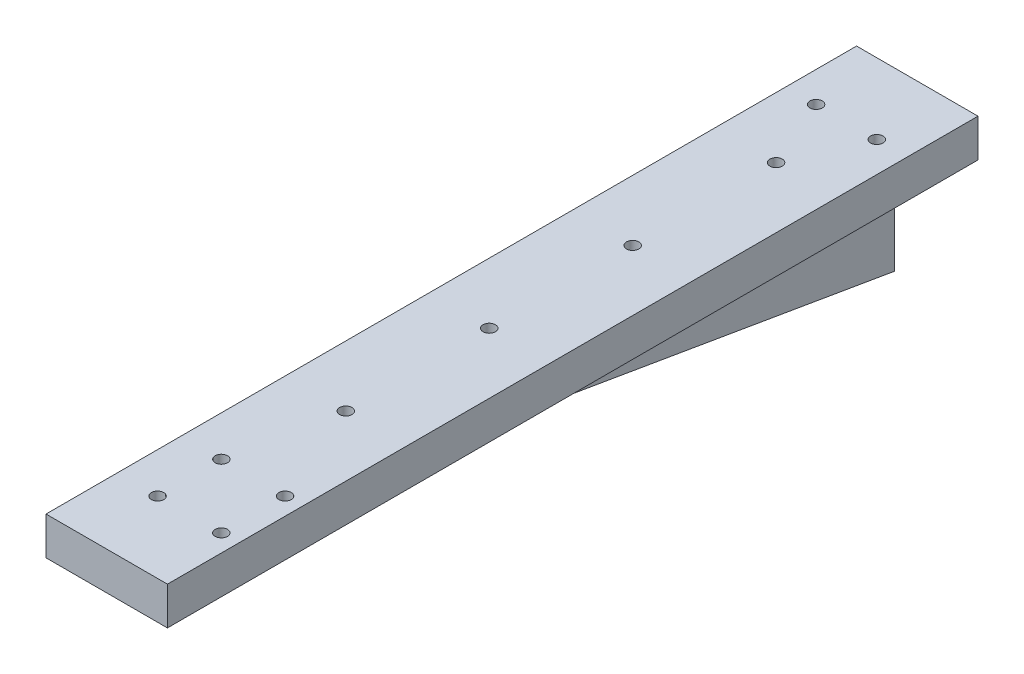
from build123d import *

# Parameters (mm, degrees)
SKETCH1_W                            = 25.4
SKETCH1_H                            = 7.9375
EXTRUDE1_DEPTH                       = 169.545
EXTRUDE2_DEPTH                       = 7.9375
FILLET1_R                            = 6.35
F_8_32_TAPPED_HOLE1_D                = 3.4544
F_8_32_TAPPED_HOLE1_DEPTH            = 10.70864
F_5_40_TAPPED_HOLE1_D                = 2.5781
F_5_40_TAPPED_HOLE1_DEPTH            = 10.795
F_5_40_TAPPED_HOLE1_TIP              = 0.774539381
F_5_40_TAPPED_HOLE2_D                = 2.5781
F_5_40_TAPPED_HOLE3_D                = 2.5781
F_3_16_0_187500_DIAMETER_HOLE1_D     = 4.7879
F_3_16_0_187500_DIAMETER_HOLE1_DEPTH = 6.35
F_3_16_0_187500_DIAMETER_HOLE1_TIP   = 1.438430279
F_5_40_TAPPED_HOLE4_D                = 2.5781
F_5_40_TAPPED_HOLE4_DEPTH            = 10.795
F_3_32_0_09375_DIAMETER_HOLE1_D      = 2.38125
F_3_32_0_09375_DIAMETER_HOLE1_DEPTH  = 3.81


with BuildPart() as part:
    # Sketch1 → Extrude1 (new body)
    with BuildSketch(Plane.XY):
        with Locations((0, -0.00635)):
            Rectangle(SKETCH1_W, SKETCH1_H)
    extrude(amount=EXTRUDE1_DEPTH)

    # Sketch3 → Extrude2 (add)
    with BuildSketch(Plane.ZY.offset(12.7)):
        Polygon((0, -3.9751), (0, -32.8676), (169.545, -3.9751), align=None)
    extrude(amount=-EXTRUDE2_DEPTH)

    # Fillet1
    fillet1_edges = [part.edges().sort_by_distance(p)[0] for p in [
        (-4.7625, -3.9751, 84.7725),
    ]]
    fillet(fillet1_edges, radius=FILLET1_R)

    # 8-32 Tapped Hole1
    with Locations(Plane(origin=(0, 0, 0), x_dir=(-1, 0, 0), z_dir=(0, 0, -1))):
        with Locations((8.7376, 0), (8.7376, -25.2476), (-8.7376, 0)):
            Hole(F_8_32_TAPPED_HOLE1_D / 2, depth=F_8_32_TAPPED_HOLE1_DEPTH)

    # 5-40 Tapped Hole1
    with Locations(Plane.ZY.offset(12.7)):
        with Locations((5.3975, -4.4958)):
            Hole(F_5_40_TAPPED_HOLE1_D / 2, depth=F_5_40_TAPPED_HOLE1_DEPTH)
            with Locations((0, 0, -(F_5_40_TAPPED_HOLE1_DEPTH + F_5_40_TAPPED_HOLE1_TIP / 2))):  # 118° drill point
                Cone(0, F_5_40_TAPPED_HOLE1_D / 2, F_5_40_TAPPED_HOLE1_TIP, mode=Mode.SUBTRACT)

    # 5-40 Tapped Hole2 (through all)
    with Locations(Plane(origin=(0, 3.9624, 0), x_dir=(-1, 0, 0), z_dir=(0, 1, 0))):
        with Locations((-9.04875, 154.6225), (4.28625, 154.6225), (4.28625, 141.2875), (-9.04875, 141.2875)):
            Hole(F_5_40_TAPPED_HOLE2_D / 2)

    # 5-40 Tapped Hole3 (through all)
    with Locations(Plane(origin=(0, 3.9624, 0), x_dir=(-1, 0, 0), z_dir=(0, 1, 0))):
        with Locations((0, 29.5326), (0, 59.5326), (0, 89.5326), (0, 119.5326)):
            Hole(F_5_40_TAPPED_HOLE3_D / 2)

    # 3_16 _0.187500_ Diameter Hole1
    with Locations(Plane(origin=(0, 0, 0), x_dir=(-1, 0, 0), z_dir=(0, 0, -1))):
        with Locations((8.7376, -12.6238), (0, 0)):
            Hole(F_3_16_0_187500_DIAMETER_HOLE1_D / 2, depth=F_3_16_0_187500_DIAMETER_HOLE1_DEPTH)
            with Locations((0, 0, -(F_3_16_0_187500_DIAMETER_HOLE1_DEPTH + F_3_16_0_187500_DIAMETER_HOLE1_TIP / 2))):  # 118° drill point
                Cone(0, F_3_16_0_187500_DIAMETER_HOLE1_D / 2, F_3_16_0_187500_DIAMETER_HOLE1_TIP, mode=Mode.SUBTRACT)

    # 5-40 Tapped Hole4
    with Locations(Plane(origin=(0, 3.9624, 0), x_dir=(-1, 0, 0), z_dir=(0, 1, 0))):
        with Locations((6.35, 14.8082), (-6.35, 14.8082)):
            Hole(F_5_40_TAPPED_HOLE4_D / 2, depth=F_5_40_TAPPED_HOLE4_DEPTH)

    # 3_32 _0.09375_ Diameter Hole1
    with Locations(Plane.ZY.offset(12.7)):
        with Locations((5.3975, -16.4338)):
            Hole(F_3_32_0_09375_DIAMETER_HOLE1_D / 2, depth=F_3_32_0_09375_DIAMETER_HOLE1_DEPTH)


solid = part.part
